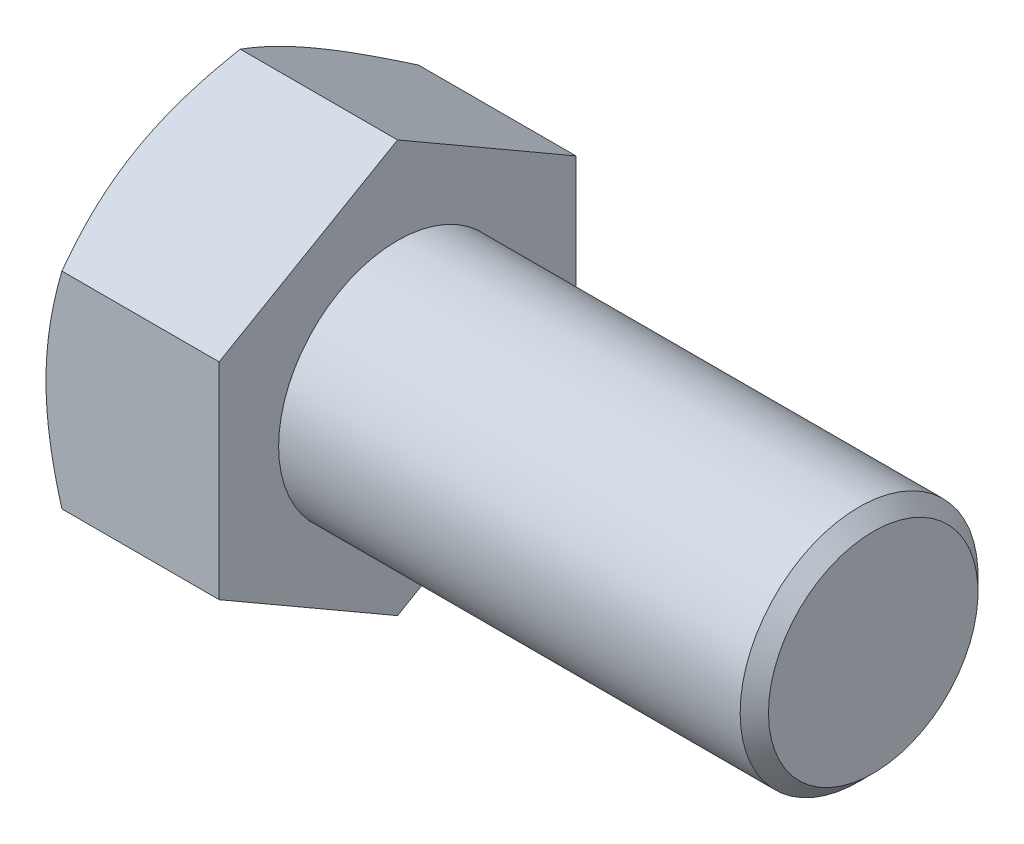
from build123d import *

# Parameters (mm, degrees)
BASEHEAD_DEPTH = 9.2456


with BuildPart() as part:
    # Sketch1 → BaseHead (new body)
    with BuildSketch(Plane(origin=(0, 0, 0), x_dir=(0, 0, -1), z_dir=(1, 0, 0))):
        Polygon((9.525, 5.499261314), (9.525, -5.499261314), (0, -10.998522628), (-9.525, -5.499261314), (-9.525, 5.499261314), (0, 10.998522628), align=None)
    extrude(amount=BASEHEAD_DEPTH)

    # BodySke → BaseBody (revolve)
    with BuildSketch(Plane.XY, mode=Mode.PRIVATE) as basebody_sk:
        Polygon((0, 0), (34.6456, 0), (34.6456, 5.59435), (33.88995, 6.35), (0, 6.35), align=None)
    revolve(basebody_sk.sketch.rotate(Axis((0, 0, 0), (1, 0, 0)), 90), axis=Axis((0, 0, 0), (1, 0, 0)))

    # Sketch3 → HeadChamfer (revolve, cut)
    with BuildSketch(Plane.XY):
        Polygon((0, 9.525), (4.516912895, 17.348522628), (4.516912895, 23.698522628), (-12.7, 23.698522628), (-12.7, 9.525), align=None)
    revolve(axis=Axis((0, 0, 0), (1, 0, 0)), mode=Mode.SUBTRACT)


solid = part.part
